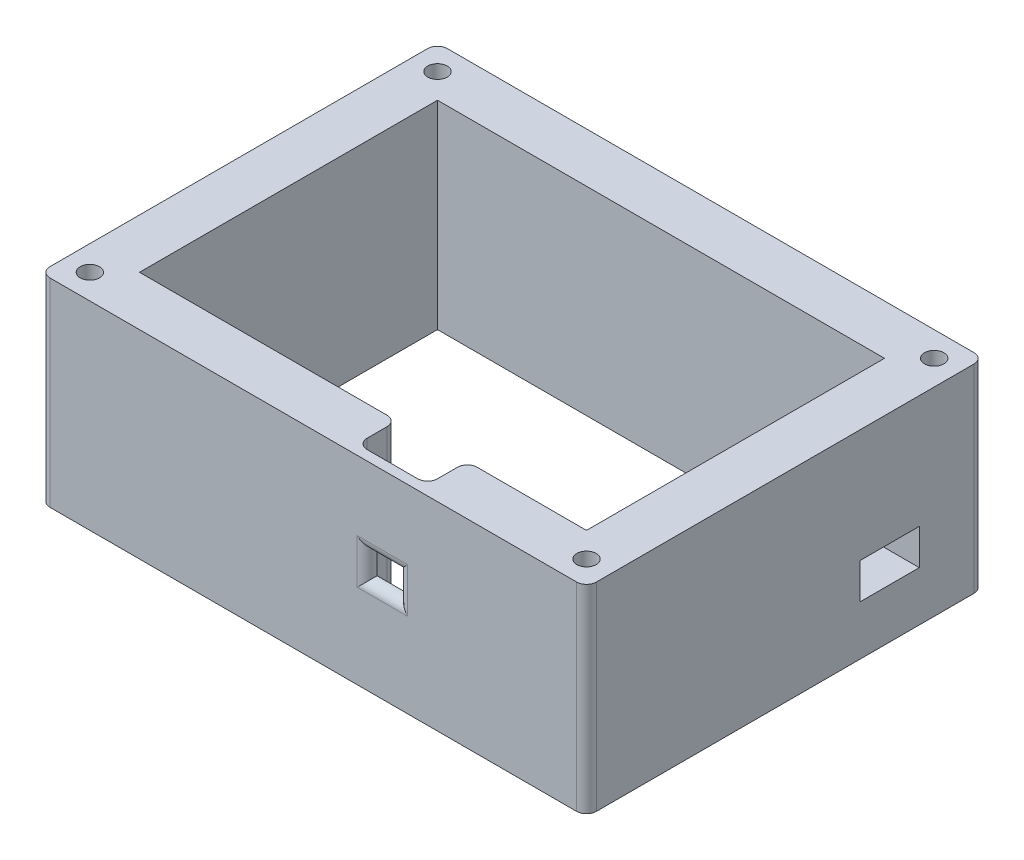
ISO-10303-21;
HEADER;
FILE_DESCRIPTION(('STEP AP214'),'2;1');
FILE_NAME('part.step','',(''),(''),'','','');
FILE_SCHEMA(('AUTOMOTIVE_DESIGN { 1 0 10303 214 1 1 1 1 }'));
ENDSEC;
DATA;
#1=APPLICATION_CONTEXT('core data for automotive mechanical design processes');
#2=APPLICATION_PROTOCOL_DEFINITION('international standard','automotive_design',2000,#1);
#3=PRODUCT_CONTEXT('',#1,'mechanical');
#4=PRODUCT('Part','Part','',(#3));
#5=PRODUCT_RELATED_PRODUCT_CATEGORY('part','',(#4));
#6=PRODUCT_DEFINITION_FORMATION('','',#4);
#7=PRODUCT_DEFINITION_CONTEXT('part definition',#1,'design');
#8=PRODUCT_DEFINITION('design','',#6,#7);
#9=PRODUCT_DEFINITION_SHAPE('','',#8);
#10=(LENGTH_UNIT() NAMED_UNIT(*) SI_UNIT(.MILLI.,.METRE.));
#11=(NAMED_UNIT(*) PLANE_ANGLE_UNIT() SI_UNIT($,.RADIAN.));
#12=(NAMED_UNIT(*) SI_UNIT($,.STERADIAN.) SOLID_ANGLE_UNIT());
#13=UNCERTAINTY_MEASURE_WITH_UNIT(LENGTH_MEASURE(1.E-05),#10,'distance_accuracy_value','');
#14=(GEOMETRIC_REPRESENTATION_CONTEXT(3) GLOBAL_UNCERTAINTY_ASSIGNED_CONTEXT((#13)) GLOBAL_UNIT_ASSIGNED_CONTEXT((#10,
#11,#12)) REPRESENTATION_CONTEXT('',''));
#15=CARTESIAN_POINT('',(0.,0.,0.));
#16=DIRECTION('',(0.,0.,1.));
#17=DIRECTION('',(1.,0.,0.));
#18=AXIS2_PLACEMENT_3D('',#15,#16,#17);
#19=CARTESIAN_POINT('',(-57.15,50.8,38.1));
#20=DIRECTION('',(0.,0.,-1.));
#21=DIRECTION('',(-1.,0.,0.));
#22=AXIS2_PLACEMENT_3D('',#19,#20,#21);
#23=PLANE('',#22);
#24=DIRECTION('',(1.,0.,0.));
#25=VECTOR('',#24,1.);
#26=CARTESIAN_POINT('',(-57.15,50.8,38.1));
#27=LINE('',#26,#25);
#28=CARTESIAN_POINT('',(-57.15,50.8,38.1));
#29=VERTEX_POINT('',#28);
#30=CARTESIAN_POINT('',(6.14523945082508,50.8,38.1));
#31=VERTEX_POINT('',#30);
#32=EDGE_CURVE('E411',#29,#31,#27,.T.);
#33=ORIENTED_EDGE('',*,*,#32,.T.);
#34=DIRECTION('',(0.,-1.,0.));
#35=VECTOR('',#34,1.);
#36=CARTESIAN_POINT('',(6.14523945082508,0.,38.1));
#37=LINE('',#36,#35);
#38=CARTESIAN_POINT('',(6.14523945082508,0.,38.1));
#39=VERTEX_POINT('',#38);
#40=EDGE_CURVE('E516',#31,#39,#37,.T.);
#41=ORIENTED_EDGE('',*,*,#40,.T.);
#42=DIRECTION('',(1.,0.,0.));
#43=VECTOR('',#42,1.);
#44=CARTESIAN_POINT('',(-57.15,0.,38.1));
#45=LINE('',#44,#43);
#46=CARTESIAN_POINT('',(-57.15,0.,38.1));
#47=VERTEX_POINT('',#46);
#48=EDGE_CURVE('E403',#47,#39,#45,.T.);
#49=ORIENTED_EDGE('',*,*,#48,.F.);
#50=DIRECTION('',(0.,-1.,0.));
#51=VECTOR('',#50,1.);
#52=CARTESIAN_POINT('',(-57.15,50.8,38.1));
#53=LINE('',#52,#51);
#54=EDGE_CURVE('E434',#29,#47,#53,.T.);
#55=ORIENTED_EDGE('',*,*,#54,.F.);
#56=EDGE_LOOP('',(#33,#41,#49,#55));
#57=FACE_BOUND('',#56,.T.);
#58=ADVANCED_FACE('F41',(#57),#23,.T.);
#59=CARTESIAN_POINT('',(63.5,50.8,-44.45));
#60=DIRECTION('',(0.,-1.,0.));
#61=DIRECTION('',(0.,0.,-1.));
#62=AXIS2_PLACEMENT_3D('',#59,#60,#61);
#63=CYLINDRICAL_SURFACE('',#62,2.4765);
#64=CARTESIAN_POINT('',(63.5,50.8,-44.45));
#65=DIRECTION('',(0.,1.,0.));
#66=DIRECTION('',(0.,0.,1.));
#67=AXIS2_PLACEMENT_3D('',#64,#65,#66);
#68=CIRCLE('',#67,2.4765);
#69=CARTESIAN_POINT('',(63.5,50.8,-41.9735));
#70=VERTEX_POINT('',#69);
#71=EDGE_CURVE('E394',#70,#70,#68,.T.);
#72=ORIENTED_EDGE('',*,*,#71,.T.);
#73=EDGE_LOOP('',(#72));
#74=FACE_BOUND('',#73,.T.);
#75=CARTESIAN_POINT('',(63.5,30.226,-44.45));
#76=DIRECTION('',(0.,-1.,0.));
#77=DIRECTION('',(0.,0.,-1.));
#78=AXIS2_PLACEMENT_3D('',#75,#76,#77);
#79=CIRCLE('',#78,2.4765);
#80=CARTESIAN_POINT('',(63.5,30.226,-46.9265));
#81=VERTEX_POINT('',#80);
#82=EDGE_CURVE('E374',#81,#81,#79,.T.);
#83=ORIENTED_EDGE('',*,*,#82,.T.);
#84=EDGE_LOOP('',(#83));
#85=FACE_BOUND('',#84,.T.);
#86=ADVANCED_FACE('F679',(#74,#85),#63,.F.);
#87=CARTESIAN_POINT('',(-63.5,50.8,-44.45));
#88=DIRECTION('',(0.,-1.,0.));
#89=DIRECTION('',(0.,0.,-1.));
#90=AXIS2_PLACEMENT_3D('',#87,#88,#89);
#91=CYLINDRICAL_SURFACE('',#90,2.4765);
#92=CARTESIAN_POINT('',(-63.5,50.8,-44.45));
#93=DIRECTION('',(0.,1.,0.));
#94=DIRECTION('',(0.,0.,1.));
#95=AXIS2_PLACEMENT_3D('',#92,#93,#94);
#96=CIRCLE('',#95,2.4765);
#97=CARTESIAN_POINT('',(-63.5,50.8,-41.9735));
#98=VERTEX_POINT('',#97);
#99=EDGE_CURVE('E390',#98,#98,#96,.T.);
#100=ORIENTED_EDGE('',*,*,#99,.T.);
#101=EDGE_LOOP('',(#100));
#102=FACE_BOUND('',#101,.T.);
#103=CARTESIAN_POINT('',(-63.5,30.226,-44.45));
#104=DIRECTION('',(0.,-1.,0.));
#105=DIRECTION('',(0.,0.,-1.));
#106=AXIS2_PLACEMENT_3D('',#103,#104,#105);
#107=CIRCLE('',#106,2.4765);
#108=CARTESIAN_POINT('',(-63.5,30.226,-46.9265));
#109=VERTEX_POINT('',#108);
#110=EDGE_CURVE('E484',#109,#109,#107,.T.);
#111=ORIENTED_EDGE('',*,*,#110,.T.);
#112=EDGE_LOOP('',(#111));
#113=FACE_BOUND('',#112,.T.);
#114=ADVANCED_FACE('F686',(#102,#113),#91,.F.);
#115=CARTESIAN_POINT('',(-63.5,50.8,44.45));
#116=DIRECTION('',(0.,-1.,0.));
#117=DIRECTION('',(0.,0.,-1.));
#118=AXIS2_PLACEMENT_3D('',#115,#116,#117);
#119=CYLINDRICAL_SURFACE('',#118,2.4765);
#120=CARTESIAN_POINT('',(-63.5,50.8,44.45));
#121=DIRECTION('',(0.,1.,0.));
#122=DIRECTION('',(0.,0.,1.));
#123=AXIS2_PLACEMENT_3D('',#120,#121,#122);
#124=CIRCLE('',#123,2.4765);
#125=CARTESIAN_POINT('',(-63.5,50.8,46.9265));
#126=VERTEX_POINT('',#125);
#127=EDGE_CURVE('E386',#126,#126,#124,.T.);
#128=ORIENTED_EDGE('',*,*,#127,.T.);
#129=EDGE_LOOP('',(#128));
#130=FACE_BOUND('',#129,.T.);
#131=CARTESIAN_POINT('',(-63.5,30.226,44.45));
#132=DIRECTION('',(0.,-1.,0.));
#133=DIRECTION('',(0.,0.,-1.));
#134=AXIS2_PLACEMENT_3D('',#131,#132,#133);
#135=CIRCLE('',#134,2.4765);
#136=CARTESIAN_POINT('',(-63.5,30.226,41.9735));
#137=VERTEX_POINT('',#136);
#138=EDGE_CURVE('E480',#137,#137,#135,.T.);
#139=ORIENTED_EDGE('',*,*,#138,.T.);
#140=EDGE_LOOP('',(#139));
#141=FACE_BOUND('',#140,.T.);
#142=ADVANCED_FACE('F900',(#130,#141),#119,.F.);
#143=CARTESIAN_POINT('',(63.5,50.8,44.45));
#144=DIRECTION('',(0.,-1.,0.));
#145=DIRECTION('',(0.,0.,-1.));
#146=AXIS2_PLACEMENT_3D('',#143,#144,#145);
#147=CYLINDRICAL_SURFACE('',#146,2.4765);
#148=CARTESIAN_POINT('',(63.5,50.8,44.45));
#149=DIRECTION('',(0.,1.,0.));
#150=DIRECTION('',(0.,0.,1.));
#151=AXIS2_PLACEMENT_3D('',#148,#149,#150);
#152=CIRCLE('',#151,2.4765);
#153=CARTESIAN_POINT('',(63.5,50.8,46.9265));
#154=VERTEX_POINT('',#153);
#155=EDGE_CURVE('E379',#154,#154,#152,.T.);
#156=ORIENTED_EDGE('',*,*,#155,.T.);
#157=EDGE_LOOP('',(#156));
#158=FACE_BOUND('',#157,.T.);
#159=CARTESIAN_POINT('',(63.5,30.226,44.45));
#160=DIRECTION('',(0.,-1.,0.));
#161=DIRECTION('',(0.,0.,-1.));
#162=AXIS2_PLACEMENT_3D('',#159,#160,#161);
#163=CIRCLE('',#162,2.4765);
#164=CARTESIAN_POINT('',(63.5,30.226,41.9735));
#165=VERTEX_POINT('',#164);
#166=EDGE_CURVE('E345',#165,#165,#163,.T.);
#167=ORIENTED_EDGE('',*,*,#166,.T.);
#168=EDGE_LOOP('',(#167));
#169=FACE_BOUND('',#168,.T.);
#170=ADVANCED_FACE('F897',(#158,#169),#147,.F.);
#171=CARTESIAN_POINT('',(0.,50.8,0.));
#172=DIRECTION('',(0.,-1.,0.));
#173=DIRECTION('',(0.,0.,-1.));
#174=AXIS2_PLACEMENT_3D('',#171,#172,#173);
#175=PLANE('',#174);
#176=DIRECTION('',(-1.,0.,0.));
#177=VECTOR('',#176,1.);
#178=CARTESIAN_POINT('',(-69.85,50.8,-50.8));
#179=LINE('',#178,#177);
#180=CARTESIAN_POINT('',(67.31,50.8,-50.8));
#181=VERTEX_POINT('',#180);
#182=CARTESIAN_POINT('',(-67.31,50.8,-50.8));
#183=VERTEX_POINT('',#182);
#184=EDGE_CURVE('E449',#181,#183,#179,.T.);
#185=ORIENTED_EDGE('',*,*,#184,.T.);
#186=CARTESIAN_POINT('',(-67.31,50.8,-48.26));
#187=DIRECTION('',(0.,-1.,0.));
#188=DIRECTION('',(0.,0.,-1.));
#189=AXIS2_PLACEMENT_3D('',#186,#187,#188);
#190=CIRCLE('',#189,2.54);
#191=CARTESIAN_POINT('',(-69.85,50.8,-48.26));
#192=VERTEX_POINT('',#191);
#193=EDGE_CURVE('E606',#183,#192,#190,.F.);
#194=ORIENTED_EDGE('',*,*,#193,.T.);
#195=DIRECTION('',(0.,0.,1.));
#196=VECTOR('',#195,1.);
#197=CARTESIAN_POINT('',(-69.85,50.8,50.8));
#198=LINE('',#197,#196);
#199=CARTESIAN_POINT('',(-69.85,50.8,48.26));
#200=VERTEX_POINT('',#199);
#201=EDGE_CURVE('E454',#192,#200,#198,.T.);
#202=ORIENTED_EDGE('',*,*,#201,.T.);
#203=CARTESIAN_POINT('',(-67.31,50.8,48.26));
#204=DIRECTION('',(0.,-1.,0.));
#205=DIRECTION('',(0.,0.,-1.));
#206=AXIS2_PLACEMENT_3D('',#203,#204,#205);
#207=CIRCLE('',#206,2.54);
#208=CARTESIAN_POINT('',(-67.31,50.8,50.8));
#209=VERTEX_POINT('',#208);
#210=EDGE_CURVE('E603',#200,#209,#207,.F.);
#211=ORIENTED_EDGE('',*,*,#210,.T.);
#212=DIRECTION('',(1.,0.,0.));
#213=VECTOR('',#212,1.);
#214=CARTESIAN_POINT('',(-69.85,50.8,50.8));
#215=LINE('',#214,#213);
#216=CARTESIAN_POINT('',(67.31,50.8,50.8));
#217=VERTEX_POINT('',#216);
#218=EDGE_CURVE('E458',#209,#217,#215,.T.);
#219=ORIENTED_EDGE('',*,*,#218,.T.);
#220=CARTESIAN_POINT('',(67.31,50.8,48.26));
#221=DIRECTION('',(0.,-1.,0.));
#222=DIRECTION('',(0.,0.,-1.));
#223=AXIS2_PLACEMENT_3D('',#220,#221,#222);
#224=CIRCLE('',#223,2.54);
#225=CARTESIAN_POINT('',(69.85,50.8,48.26));
#226=VERTEX_POINT('',#225);
#227=EDGE_CURVE('E600',#217,#226,#224,.F.);
#228=ORIENTED_EDGE('',*,*,#227,.T.);
#229=DIRECTION('',(0.,0.,-1.));
#230=VECTOR('',#229,1.);
#231=CARTESIAN_POINT('',(69.85,50.8,50.8));
#232=LINE('',#231,#230);
#233=CARTESIAN_POINT('',(69.85,50.8,-48.26));
#234=VERTEX_POINT('',#233);
#235=EDGE_CURVE('E445',#226,#234,#232,.T.);
#236=ORIENTED_EDGE('',*,*,#235,.T.);
#237=CARTESIAN_POINT('',(67.31,50.8,-48.26));
#238=DIRECTION('',(0.,-1.,0.));
#239=DIRECTION('',(0.,0.,-1.));
#240=AXIS2_PLACEMENT_3D('',#237,#238,#239);
#241=CIRCLE('',#240,2.54);
#242=EDGE_CURVE('E597',#234,#181,#241,.F.);
#243=ORIENTED_EDGE('',*,*,#242,.T.);
#244=EDGE_LOOP('',(#185,#194,#202,#211,#219,#228,#236,#243));
#245=FACE_BOUND('',#244,.T.);
#246=CARTESIAN_POINT('',(29.21,50.8,38.1));
#247=VERTEX_POINT('',#246);
#248=CARTESIAN_POINT('',(57.15,50.8,38.1));
#249=VERTEX_POINT('',#248);
#250=EDGE_CURVE('E410',#247,#249,#27,.T.);
#251=ORIENTED_EDGE('',*,*,#250,.F.);
#252=CARTESIAN_POINT('',(29.21,50.8,40.64));
#253=DIRECTION('',(0.,-1.,0.));
#254=DIRECTION('',(0.,0.,-1.));
#255=AXIS2_PLACEMENT_3D('',#252,#253,#254);
#256=CIRCLE('',#255,2.54);
#257=CARTESIAN_POINT('',(26.67,50.8,40.64));
#258=VERTEX_POINT('',#257);
#259=EDGE_CURVE('E513',#247,#258,#256,.F.);
#260=ORIENTED_EDGE('',*,*,#259,.T.);
#261=DIRECTION('',(0.,0.,1.));
#262=VECTOR('',#261,1.);
#263=CARTESIAN_POINT('',(26.67,50.8,38.1));
#264=LINE('',#263,#262);
#265=CARTESIAN_POINT('',(26.67,50.8,45.72));
#266=VERTEX_POINT('',#265);
#267=EDGE_CURVE('E300',#258,#266,#264,.T.);
#268=ORIENTED_EDGE('',*,*,#267,.T.);
#269=CARTESIAN_POINT('',(24.13,50.8,45.72));
#270=DIRECTION('',(0.,-1.,0.));
#271=DIRECTION('',(0.,0.,-1.));
#272=AXIS2_PLACEMENT_3D('',#269,#270,#271);
#273=CIRCLE('',#272,2.54);
#274=CARTESIAN_POINT('',(24.13,50.8,48.26));
#275=VERTEX_POINT('',#274);
#276=EDGE_CURVE('E543',#266,#275,#273,.T.);
#277=ORIENTED_EDGE('',*,*,#276,.T.);
#278=DIRECTION('',(-1.,0.,0.));
#279=VECTOR('',#278,1.);
#280=CARTESIAN_POINT('',(8.68523945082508,50.8,48.26));
#281=LINE('',#280,#279);
#282=CARTESIAN_POINT('',(11.2252394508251,50.8,48.26));
#283=VERTEX_POINT('',#282);
#284=EDGE_CURVE('E304',#275,#283,#281,.T.);
#285=ORIENTED_EDGE('',*,*,#284,.T.);
#286=CARTESIAN_POINT('',(11.2252394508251,50.8,45.72));
#287=DIRECTION('',(0.,-1.,0.));
#288=DIRECTION('',(0.,0.,-1.));
#289=AXIS2_PLACEMENT_3D('',#286,#287,#288);
#290=CIRCLE('',#289,2.54);
#291=CARTESIAN_POINT('',(8.68523945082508,50.8,45.72));
#292=VERTEX_POINT('',#291);
#293=EDGE_CURVE('E537',#283,#292,#290,.T.);
#294=ORIENTED_EDGE('',*,*,#293,.T.);
#295=DIRECTION('',(0.,0.,-1.));
#296=VECTOR('',#295,1.);
#297=CARTESIAN_POINT('',(8.68523945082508,50.8,38.1));
#298=LINE('',#297,#296);
#299=CARTESIAN_POINT('',(8.68523945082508,50.8,40.64));
#300=VERTEX_POINT('',#299);
#301=EDGE_CURVE('E296',#292,#300,#298,.T.);
#302=ORIENTED_EDGE('',*,*,#301,.T.);
#303=CARTESIAN_POINT('',(6.14523945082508,50.8,40.64));
#304=DIRECTION('',(0.,-1.,0.));
#305=DIRECTION('',(0.,0.,-1.));
#306=AXIS2_PLACEMENT_3D('',#303,#304,#305);
#307=CIRCLE('',#306,2.54);
#308=EDGE_CURVE('E510',#300,#31,#307,.F.);
#309=ORIENTED_EDGE('',*,*,#308,.T.);
#310=ORIENTED_EDGE('',*,*,#32,.F.);
#311=DIRECTION('',(0.,0.,1.));
#312=VECTOR('',#311,1.);
#313=CARTESIAN_POINT('',(-57.15,50.8,38.1));
#314=LINE('',#313,#312);
#315=CARTESIAN_POINT('',(-57.15,50.8,-38.1));
#316=VERTEX_POINT('',#315);
#317=EDGE_CURVE('E406',#316,#29,#314,.T.);
#318=ORIENTED_EDGE('',*,*,#317,.F.);
#319=DIRECTION('',(-1.,0.,0.));
#320=VECTOR('',#319,1.);
#321=CARTESIAN_POINT('',(-57.15,50.8,-38.1));
#322=LINE('',#321,#320);
#323=CARTESIAN_POINT('',(57.15,50.8,-38.1));
#324=VERTEX_POINT('',#323);
#325=EDGE_CURVE('E402',#324,#316,#322,.T.);
#326=ORIENTED_EDGE('',*,*,#325,.F.);
#327=DIRECTION('',(0.,0.,-1.));
#328=VECTOR('',#327,1.);
#329=CARTESIAN_POINT('',(57.15,50.8,38.1));
#330=LINE('',#329,#328);
#331=EDGE_CURVE('E399',#249,#324,#330,.T.);
#332=ORIENTED_EDGE('',*,*,#331,.F.);
#333=EDGE_LOOP('',(#251,#260,#268,#277,#285,#294,#302,#309,#310,#318,#326,#332));
#334=FACE_BOUND('',#333,.T.);
#335=ORIENTED_EDGE('',*,*,#71,.F.);
#336=EDGE_LOOP('',(#335));
#337=FACE_BOUND('',#336,.T.);
#338=ORIENTED_EDGE('',*,*,#99,.F.);
#339=EDGE_LOOP('',(#338));
#340=FACE_BOUND('',#339,.T.);
#341=ORIENTED_EDGE('',*,*,#127,.F.);
#342=EDGE_LOOP('',(#341));
#343=FACE_BOUND('',#342,.T.);
#344=ORIENTED_EDGE('',*,*,#155,.F.);
#345=EDGE_LOOP('',(#344));
#346=FACE_BOUND('',#345,.T.);
#347=ADVANCED_FACE('F716',(#245,#334,#337,#340,#343,#346),#175,.F.);
#348=CARTESIAN_POINT('',(0.,0.,0.));
#349=DIRECTION('',(0.,-1.,0.));
#350=DIRECTION('',(0.,0.,-1.));
#351=AXIS2_PLACEMENT_3D('',#348,#349,#350);
#352=PLANE('',#351);
#353=DIRECTION('',(0.,0.,1.));
#354=VECTOR('',#353,1.);
#355=CARTESIAN_POINT('',(26.67,0.,0.));
#356=LINE('',#355,#354);
#357=CARTESIAN_POINT('',(26.67,0.,40.64));
#358=VERTEX_POINT('',#357);
#359=CARTESIAN_POINT('',(26.67,0.,45.72));
#360=VERTEX_POINT('',#359);
#361=EDGE_CURVE('E308',#358,#360,#356,.T.);
#362=ORIENTED_EDGE('',*,*,#361,.F.);
#363=CARTESIAN_POINT('',(29.21,0.,40.64));
#364=DIRECTION('',(0.,-1.,0.));
#365=DIRECTION('',(0.,0.,-1.));
#366=AXIS2_PLACEMENT_3D('',#363,#364,#365);
#367=CIRCLE('',#366,2.54);
#368=CARTESIAN_POINT('',(29.21,0.,38.1));
#369=VERTEX_POINT('',#368);
#370=EDGE_CURVE('E504',#358,#369,#367,.T.);
#371=ORIENTED_EDGE('',*,*,#370,.T.);
#372=CARTESIAN_POINT('',(57.15,0.,38.1));
#373=VERTEX_POINT('',#372);
#374=EDGE_CURVE('E427',#369,#373,#45,.T.);
#375=ORIENTED_EDGE('',*,*,#374,.T.);
#376=DIRECTION('',(0.,0.,-1.));
#377=VECTOR('',#376,1.);
#378=CARTESIAN_POINT('',(57.15,0.,38.1));
#379=LINE('',#378,#377);
#380=CARTESIAN_POINT('',(57.15,0.,-38.1));
#381=VERTEX_POINT('',#380);
#382=EDGE_CURVE('E398',#373,#381,#379,.T.);
#383=ORIENTED_EDGE('',*,*,#382,.T.);
#384=DIRECTION('',(-1.,0.,0.));
#385=VECTOR('',#384,1.);
#386=CARTESIAN_POINT('',(-57.15,0.,-38.1));
#387=LINE('',#386,#385);
#388=CARTESIAN_POINT('',(-57.15,0.,-38.1));
#389=VERTEX_POINT('',#388);
#390=EDGE_CURVE('E419',#381,#389,#387,.T.);
#391=ORIENTED_EDGE('',*,*,#390,.T.);
#392=DIRECTION('',(0.,0.,1.));
#393=VECTOR('',#392,1.);
#394=CARTESIAN_POINT('',(-57.15,0.,38.1));
#395=LINE('',#394,#393);
#396=EDGE_CURVE('E423',#389,#47,#395,.T.);
#397=ORIENTED_EDGE('',*,*,#396,.T.);
#398=ORIENTED_EDGE('',*,*,#48,.T.);
#399=CARTESIAN_POINT('',(6.14523945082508,0.,40.64));
#400=DIRECTION('',(0.,-1.,0.));
#401=DIRECTION('',(0.,0.,-1.));
#402=AXIS2_PLACEMENT_3D('',#399,#400,#401);
#403=CIRCLE('',#402,2.54);
#404=CARTESIAN_POINT('',(8.68523945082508,0.,40.64));
#405=VERTEX_POINT('',#404);
#406=EDGE_CURVE('E501',#39,#405,#403,.T.);
#407=ORIENTED_EDGE('',*,*,#406,.T.);
#408=DIRECTION('',(0.,0.,-1.));
#409=VECTOR('',#408,1.);
#410=CARTESIAN_POINT('',(8.68523945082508,0.,0.));
#411=LINE('',#410,#409);
#412=CARTESIAN_POINT('',(8.68523945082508,0.,45.72));
#413=VERTEX_POINT('',#412);
#414=EDGE_CURVE('E312',#413,#405,#411,.T.);
#415=ORIENTED_EDGE('',*,*,#414,.F.);
#416=CARTESIAN_POINT('',(11.2252394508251,0.,45.72));
#417=DIRECTION('',(0.,-1.,0.));
#418=DIRECTION('',(0.,0.,-1.));
#419=AXIS2_PLACEMENT_3D('',#416,#417,#418);
#420=CIRCLE('',#419,2.54);
#421=CARTESIAN_POINT('',(11.2252394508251,0.,48.26));
#422=VERTEX_POINT('',#421);
#423=EDGE_CURVE('E534',#413,#422,#420,.F.);
#424=ORIENTED_EDGE('',*,*,#423,.T.);
#425=DIRECTION('',(-1.,0.,0.));
#426=VECTOR('',#425,1.);
#427=CARTESIAN_POINT('',(0.,0.,48.26));
#428=LINE('',#427,#426);
#429=CARTESIAN_POINT('',(24.13,0.,48.26));
#430=VERTEX_POINT('',#429);
#431=EDGE_CURVE('E462',#430,#422,#428,.T.);
#432=ORIENTED_EDGE('',*,*,#431,.F.);
#433=CARTESIAN_POINT('',(24.13,0.,45.72));
#434=DIRECTION('',(0.,-1.,0.));
#435=DIRECTION('',(0.,0.,-1.));
#436=AXIS2_PLACEMENT_3D('',#433,#434,#435);
#437=CIRCLE('',#436,2.54);
#438=EDGE_CURVE('E540',#430,#360,#437,.F.);
#439=ORIENTED_EDGE('',*,*,#438,.T.);
#440=EDGE_LOOP('',(#362,#371,#375,#383,#391,#397,#398,#407,#415,#424,#432,#439));
#441=FACE_BOUND('',#440,.T.);
#442=CARTESIAN_POINT('',(-63.5,0.,44.45));
#443=DIRECTION('',(0.,1.,0.));
#444=DIRECTION('',(0.,0.,1.));
#445=AXIS2_PLACEMENT_3D('',#442,#443,#444);
#446=CIRCLE('',#445,5.6515);
#447=CARTESIAN_POINT('',(-63.5,0.,50.1015));
#448=VERTEX_POINT('',#447);
#449=EDGE_CURVE('E370',#448,#448,#446,.T.);
#450=ORIENTED_EDGE('',*,*,#449,.T.);
#451=EDGE_LOOP('',(#450));
#452=FACE_BOUND('',#451,.T.);
#453=CARTESIAN_POINT('',(63.5,0.,44.45));
#454=DIRECTION('',(0.,1.,0.));
#455=DIRECTION('',(0.,0.,1.));
#456=AXIS2_PLACEMENT_3D('',#453,#454,#455);
#457=CIRCLE('',#456,5.6515);
#458=CARTESIAN_POINT('',(63.5,0.,50.1015));
#459=VERTEX_POINT('',#458);
#460=EDGE_CURVE('E362',#459,#459,#457,.T.);
#461=ORIENTED_EDGE('',*,*,#460,.T.);
#462=EDGE_LOOP('',(#461));
#463=FACE_BOUND('',#462,.T.);
#464=CARTESIAN_POINT('',(63.5,0.,-44.45));
#465=DIRECTION('',(0.,1.,0.));
#466=DIRECTION('',(0.,0.,1.));
#467=AXIS2_PLACEMENT_3D('',#464,#465,#466);
#468=CIRCLE('',#467,5.6515);
#469=CARTESIAN_POINT('',(63.5,0.,-38.7985));
#470=VERTEX_POINT('',#469);
#471=EDGE_CURVE('E354',#470,#470,#468,.T.);
#472=ORIENTED_EDGE('',*,*,#471,.T.);
#473=EDGE_LOOP('',(#472));
#474=FACE_BOUND('',#473,.T.);
#475=CARTESIAN_POINT('',(-63.5,0.,-44.45));
#476=DIRECTION('',(0.,1.,0.));
#477=DIRECTION('',(0.,0.,1.));
#478=AXIS2_PLACEMENT_3D('',#475,#476,#477);
#479=CIRCLE('',#478,5.6515);
#480=CARTESIAN_POINT('',(-63.5,0.,-38.7985));
#481=VERTEX_POINT('',#480);
#482=EDGE_CURVE('E353',#481,#481,#479,.T.);
#483=ORIENTED_EDGE('',*,*,#482,.T.);
#484=EDGE_LOOP('',(#483));
#485=FACE_BOUND('',#484,.T.);
#486=DIRECTION('',(0.,0.,1.));
#487=VECTOR('',#486,1.);
#488=CARTESIAN_POINT('',(-69.85,0.,50.8));
#489=LINE('',#488,#487);
#490=CARTESIAN_POINT('',(-69.85,0.,-48.26));
#491=VERTEX_POINT('',#490);
#492=CARTESIAN_POINT('',(-69.85,0.,48.26));
#493=VERTEX_POINT('',#492);
#494=EDGE_CURVE('E470',#491,#493,#489,.T.);
#495=ORIENTED_EDGE('',*,*,#494,.F.);
#496=CARTESIAN_POINT('',(-67.31,0.,-48.26));
#497=DIRECTION('',(0.,-1.,0.));
#498=DIRECTION('',(0.,0.,-1.));
#499=AXIS2_PLACEMENT_3D('',#496,#497,#498);
#500=CIRCLE('',#499,2.54);
#501=CARTESIAN_POINT('',(-67.31,0.,-50.8));
#502=VERTEX_POINT('',#501);
#503=EDGE_CURVE('E587',#491,#502,#500,.T.);
#504=ORIENTED_EDGE('',*,*,#503,.T.);
#505=DIRECTION('',(-1.,0.,0.));
#506=VECTOR('',#505,1.);
#507=CARTESIAN_POINT('',(-69.85,0.,-50.8));
#508=LINE('',#507,#506);
#509=CARTESIAN_POINT('',(67.31,0.,-50.8));
#510=VERTEX_POINT('',#509);
#511=EDGE_CURVE('E466',#510,#502,#508,.T.);
#512=ORIENTED_EDGE('',*,*,#511,.F.);
#513=CARTESIAN_POINT('',(67.31,0.,-48.26));
#514=DIRECTION('',(0.,-1.,0.));
#515=DIRECTION('',(0.,0.,-1.));
#516=AXIS2_PLACEMENT_3D('',#513,#514,#515);
#517=CIRCLE('',#516,2.54);
#518=CARTESIAN_POINT('',(69.85,0.,-48.26));
#519=VERTEX_POINT('',#518);
#520=EDGE_CURVE('E578',#510,#519,#517,.T.);
#521=ORIENTED_EDGE('',*,*,#520,.T.);
#522=DIRECTION('',(0.,0.,-1.));
#523=VECTOR('',#522,1.);
#524=CARTESIAN_POINT('',(69.85,0.,50.8));
#525=LINE('',#524,#523);
#526=CARTESIAN_POINT('',(69.85,0.,48.26));
#527=VERTEX_POINT('',#526);
#528=EDGE_CURVE('E444',#527,#519,#525,.T.);
#529=ORIENTED_EDGE('',*,*,#528,.F.);
#530=CARTESIAN_POINT('',(67.31,0.,48.26));
#531=DIRECTION('',(0.,-1.,0.));
#532=DIRECTION('',(0.,0.,-1.));
#533=AXIS2_PLACEMENT_3D('',#530,#531,#532);
#534=CIRCLE('',#533,2.54);
#535=CARTESIAN_POINT('',(67.31,0.,50.8));
#536=VERTEX_POINT('',#535);
#537=EDGE_CURVE('E581',#527,#536,#534,.T.);
#538=ORIENTED_EDGE('',*,*,#537,.T.);
#539=DIRECTION('',(1.,0.,0.));
#540=VECTOR('',#539,1.);
#541=CARTESIAN_POINT('',(-69.85,0.,50.8));
#542=LINE('',#541,#540);
#543=CARTESIAN_POINT('',(-67.31,0.,50.8));
#544=VERTEX_POINT('',#543);
#545=EDGE_CURVE('E450',#544,#536,#542,.T.);
#546=ORIENTED_EDGE('',*,*,#545,.F.);
#547=CARTESIAN_POINT('',(-67.31,0.,48.26));
#548=DIRECTION('',(0.,-1.,0.));
#549=DIRECTION('',(0.,0.,-1.));
#550=AXIS2_PLACEMENT_3D('',#547,#548,#549);
#551=CIRCLE('',#550,2.54);
#552=EDGE_CURVE('E584',#544,#493,#551,.T.);
#553=ORIENTED_EDGE('',*,*,#552,.T.);
#554=EDGE_LOOP('',(#495,#504,#512,#521,#529,#538,#546,#553));
#555=FACE_BOUND('',#554,.T.);
#556=ADVANCED_FACE('F755',(#441,#452,#463,#474,#485,#555),#352,.T.);
#557=CARTESIAN_POINT('',(69.85,50.8,50.8));
#558=DIRECTION('',(-1.,0.,0.));
#559=DIRECTION('',(0.,0.,1.));
#560=AXIS2_PLACEMENT_3D('',#557,#558,#559);
#561=PLANE('',#560);
#562=DIRECTION('',(0.,0.,1.));
#563=VECTOR('',#562,1.);
#564=CARTESIAN_POINT('',(69.85,21.844,-19.1262));
#565=LINE('',#564,#563);
#566=CARTESIAN_POINT('',(69.85,21.844,-34.29));
#567=VERTEX_POINT('',#566);
#568=CARTESIAN_POINT('',(69.85,21.844,-19.1262));
#569=VERTEX_POINT('',#568);
#570=EDGE_CURVE('E253',#567,#569,#565,.T.);
#571=ORIENTED_EDGE('',*,*,#570,.F.);
#572=DIRECTION('',(0.,1.,0.));
#573=VECTOR('',#572,1.);
#574=CARTESIAN_POINT('',(69.85,12.7,-34.29));
#575=LINE('',#574,#573);
#576=CARTESIAN_POINT('',(69.85,12.7,-34.29));
#577=VERTEX_POINT('',#576);
#578=EDGE_CURVE('E259',#577,#567,#575,.T.);
#579=ORIENTED_EDGE('',*,*,#578,.F.);
#580=DIRECTION('',(0.,0.,-1.));
#581=VECTOR('',#580,1.);
#582=CARTESIAN_POINT('',(69.85,12.7,-19.1262));
#583=LINE('',#582,#581);
#584=CARTESIAN_POINT('',(69.85,12.7,-19.1262));
#585=VERTEX_POINT('',#584);
#586=EDGE_CURVE('E264',#585,#577,#583,.T.);
#587=ORIENTED_EDGE('',*,*,#586,.F.);
#588=DIRECTION('',(0.,-1.,0.));
#589=VECTOR('',#588,1.);
#590=CARTESIAN_POINT('',(69.85,12.7,-19.1262));
#591=LINE('',#590,#589);
#592=EDGE_CURVE('E244',#569,#585,#591,.T.);
#593=ORIENTED_EDGE('',*,*,#592,.F.);
#594=EDGE_LOOP('',(#571,#579,#587,#593));
#595=FACE_BOUND('',#594,.T.);
#596=ORIENTED_EDGE('',*,*,#235,.F.);
#597=DIRECTION('',(0.,-1.,0.));
#598=VECTOR('',#597,1.);
#599=CARTESIAN_POINT('',(69.85,50.8,48.26));
#600=LINE('',#599,#598);
#601=EDGE_CURVE('E619',#226,#527,#600,.T.);
#602=ORIENTED_EDGE('',*,*,#601,.T.);
#603=ORIENTED_EDGE('',*,*,#528,.T.);
#604=DIRECTION('',(0.,-1.,0.));
#605=VECTOR('',#604,1.);
#606=CARTESIAN_POINT('',(69.85,50.8,-48.26));
#607=LINE('',#606,#605);
#608=EDGE_CURVE('E616',#519,#234,#607,.F.);
#609=ORIENTED_EDGE('',*,*,#608,.T.);
#610=EDGE_LOOP('',(#596,#602,#603,#609));
#611=FACE_BOUND('',#610,.T.);
#612=ADVANCED_FACE('F261',(#595,#611),#561,.F.);
#613=CARTESIAN_POINT('',(-69.85,50.8,-50.8));
#614=DIRECTION('',(0.,0.,1.));
#615=DIRECTION('',(1.,0.,0.));
#616=AXIS2_PLACEMENT_3D('',#613,#614,#615);
#617=PLANE('',#616);
#618=ORIENTED_EDGE('',*,*,#511,.T.);
#619=DIRECTION('',(0.,-1.,0.));
#620=VECTOR('',#619,1.);
#621=CARTESIAN_POINT('',(-67.31,50.8,-50.8));
#622=LINE('',#621,#620);
#623=EDGE_CURVE('E594',#502,#183,#622,.F.);
#624=ORIENTED_EDGE('',*,*,#623,.T.);
#625=ORIENTED_EDGE('',*,*,#184,.F.);
#626=DIRECTION('',(0.,-1.,0.));
#627=VECTOR('',#626,1.);
#628=CARTESIAN_POINT('',(67.31,50.8,-50.8));
#629=LINE('',#628,#627);
#630=EDGE_CURVE('E590',#181,#510,#629,.T.);
#631=ORIENTED_EDGE('',*,*,#630,.T.);
#632=EDGE_LOOP('',(#618,#624,#625,#631));
#633=FACE_BOUND('',#632,.T.);
#634=ADVANCED_FACE('F798',(#633),#617,.F.);
#635=CARTESIAN_POINT('',(-69.85,50.8,50.8));
#636=DIRECTION('',(1.,0.,0.));
#637=DIRECTION('',(0.,0.,-1.));
#638=AXIS2_PLACEMENT_3D('',#635,#636,#637);
#639=PLANE('',#638);
#640=ORIENTED_EDGE('',*,*,#201,.F.);
#641=DIRECTION('',(0.,-1.,0.));
#642=VECTOR('',#641,1.);
#643=CARTESIAN_POINT('',(-69.85,50.8,-48.26));
#644=LINE('',#643,#642);
#645=EDGE_CURVE('E574',#192,#491,#644,.T.);
#646=ORIENTED_EDGE('',*,*,#645,.T.);
#647=ORIENTED_EDGE('',*,*,#494,.T.);
#648=DIRECTION('',(0.,-1.,0.));
#649=VECTOR('',#648,1.);
#650=CARTESIAN_POINT('',(-69.85,50.8,48.26));
#651=LINE('',#650,#649);
#652=EDGE_CURVE('E559',#493,#200,#651,.F.);
#653=ORIENTED_EDGE('',*,*,#652,.T.);
#654=EDGE_LOOP('',(#640,#646,#647,#653));
#655=FACE_BOUND('',#654,.T.);
#656=ADVANCED_FACE('F773',(#655),#639,.F.);
#657=CARTESIAN_POINT('',(-69.85,50.8,50.8));
#658=DIRECTION('',(0.,0.,-1.));
#659=DIRECTION('',(-1.,0.,0.));
#660=AXIS2_PLACEMENT_3D('',#657,#658,#659);
#661=PLANE('',#660);
#662=DIRECTION('',(0.,-1.,0.));
#663=VECTOR('',#662,1.);
#664=CARTESIAN_POINT('',(24.13,50.8,50.8));
#665=LINE('',#664,#663);
#666=CARTESIAN_POINT('',(24.13,33.02,50.8));
#667=VERTEX_POINT('',#666);
#668=CARTESIAN_POINT('',(24.13,21.59,50.8));
#669=VERTEX_POINT('',#668);
#670=EDGE_CURVE('E552',#667,#669,#665,.T.);
#671=ORIENTED_EDGE('',*,*,#670,.T.);
#672=DIRECTION('',(-1.,0.,0.));
#673=VECTOR('',#672,1.);
#674=CARTESIAN_POINT('',(-69.85,21.59,50.8));
#675=LINE('',#674,#673);
#676=CARTESIAN_POINT('',(11.2252394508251,21.59,50.8));
#677=VERTEX_POINT('',#676);
#678=EDGE_CURVE('E555',#669,#677,#675,.T.);
#679=ORIENTED_EDGE('',*,*,#678,.T.);
#680=DIRECTION('',(0.,1.,0.));
#681=VECTOR('',#680,1.);
#682=CARTESIAN_POINT('',(11.2252394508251,50.8,50.8));
#683=LINE('',#682,#681);
#684=CARTESIAN_POINT('',(11.2252394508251,33.02,50.8));
#685=VERTEX_POINT('',#684);
#686=EDGE_CURVE('E549',#677,#685,#683,.T.);
#687=ORIENTED_EDGE('',*,*,#686,.T.);
#688=DIRECTION('',(1.,0.,0.));
#689=VECTOR('',#688,1.);
#690=CARTESIAN_POINT('',(-69.85,33.02,50.8));
#691=LINE('',#690,#689);
#692=EDGE_CURVE('E546',#685,#667,#691,.T.);
#693=ORIENTED_EDGE('',*,*,#692,.T.);
#694=EDGE_LOOP('',(#671,#679,#687,#693));
#695=FACE_BOUND('',#694,.T.);
#696=ORIENTED_EDGE('',*,*,#218,.F.);
#697=DIRECTION('',(0.,-1.,0.));
#698=VECTOR('',#697,1.);
#699=CARTESIAN_POINT('',(-67.31,50.8,50.8));
#700=LINE('',#699,#698);
#701=EDGE_CURVE('E612',#209,#544,#700,.T.);
#702=ORIENTED_EDGE('',*,*,#701,.T.);
#703=ORIENTED_EDGE('',*,*,#545,.T.);
#704=DIRECTION('',(0.,-1.,0.));
#705=VECTOR('',#704,1.);
#706=CARTESIAN_POINT('',(67.31,50.8,50.8));
#707=LINE('',#706,#705);
#708=EDGE_CURVE('E609',#536,#217,#707,.F.);
#709=ORIENTED_EDGE('',*,*,#708,.T.);
#710=EDGE_LOOP('',(#696,#702,#703,#709));
#711=FACE_BOUND('',#710,.T.);
#712=ADVANCED_FACE('F783',(#695,#711),#661,.F.);
#713=CARTESIAN_POINT('',(57.15,50.8,38.1));
#714=DIRECTION('',(-1.,0.,0.));
#715=DIRECTION('',(0.,0.,1.));
#716=AXIS2_PLACEMENT_3D('',#713,#714,#715);
#717=PLANE('',#716);
#718=DIRECTION('',(0.,0.,-1.));
#719=VECTOR('',#718,1.);
#720=CARTESIAN_POINT('',(57.15,24.384,-19.1262));
#721=LINE('',#720,#719);
#722=CARTESIAN_POINT('',(57.15,24.384,-36.83));
#723=VERTEX_POINT('',#722);
#724=CARTESIAN_POINT('',(57.15,24.384,-16.5862));
#725=VERTEX_POINT('',#724);
#726=EDGE_CURVE('E625',#723,#725,#721,.F.);
#727=ORIENTED_EDGE('',*,*,#726,.T.);
#728=DIRECTION('',(0.,1.,0.));
#729=VECTOR('',#728,1.);
#730=CARTESIAN_POINT('',(57.15,12.7,-16.5862));
#731=LINE('',#730,#729);
#732=CARTESIAN_POINT('',(57.15,10.16,-16.5862));
#733=VERTEX_POINT('',#732);
#734=EDGE_CURVE('E634',#725,#733,#731,.F.);
#735=ORIENTED_EDGE('',*,*,#734,.T.);
#736=DIRECTION('',(0.,0.,1.));
#737=VECTOR('',#736,1.);
#738=CARTESIAN_POINT('',(57.15,10.16,-34.29));
#739=LINE('',#738,#737);
#740=CARTESIAN_POINT('',(57.15,10.16,-36.83));
#741=VERTEX_POINT('',#740);
#742=EDGE_CURVE('E631',#733,#741,#739,.F.);
#743=ORIENTED_EDGE('',*,*,#742,.T.);
#744=DIRECTION('',(0.,-1.,0.));
#745=VECTOR('',#744,1.);
#746=CARTESIAN_POINT('',(57.15,21.844,-36.83));
#747=LINE('',#746,#745);
#748=EDGE_CURVE('E628',#741,#723,#747,.F.);
#749=ORIENTED_EDGE('',*,*,#748,.T.);
#750=EDGE_LOOP('',(#727,#735,#743,#749));
#751=FACE_BOUND('',#750,.T.);
#752=ORIENTED_EDGE('',*,*,#382,.F.);
#753=DIRECTION('',(0.,-1.,0.));
#754=VECTOR('',#753,1.);
#755=CARTESIAN_POINT('',(57.15,50.8,38.1));
#756=LINE('',#755,#754);
#757=EDGE_CURVE('E415',#249,#373,#756,.T.);
#758=ORIENTED_EDGE('',*,*,#757,.F.);
#759=ORIENTED_EDGE('',*,*,#331,.T.);
#760=DIRECTION('',(0.,-1.,0.));
#761=VECTOR('',#760,1.);
#762=CARTESIAN_POINT('',(57.15,50.8,-38.1));
#763=LINE('',#762,#761);
#764=EDGE_CURVE('E440',#324,#381,#763,.T.);
#765=ORIENTED_EDGE('',*,*,#764,.T.);
#766=EDGE_LOOP('',(#752,#758,#759,#765));
#767=FACE_BOUND('',#766,.T.);
#768=ADVANCED_FACE('F754',(#751,#767),#717,.T.);
#769=CARTESIAN_POINT('',(-57.15,50.8,-38.1));
#770=DIRECTION('',(0.,0.,1.));
#771=DIRECTION('',(1.,0.,0.));
#772=AXIS2_PLACEMENT_3D('',#769,#770,#771);
#773=PLANE('',#772);
#774=ORIENTED_EDGE('',*,*,#390,.F.);
#775=ORIENTED_EDGE('',*,*,#764,.F.);
#776=ORIENTED_EDGE('',*,*,#325,.T.);
#777=DIRECTION('',(0.,-1.,0.));
#778=VECTOR('',#777,1.);
#779=CARTESIAN_POINT('',(-57.15,50.8,-38.1));
#780=LINE('',#779,#778);
#781=EDGE_CURVE('E437',#316,#389,#780,.T.);
#782=ORIENTED_EDGE('',*,*,#781,.T.);
#783=EDGE_LOOP('',(#774,#775,#776,#782));
#784=FACE_BOUND('',#783,.T.);
#785=ADVANCED_FACE('F701',(#784),#773,.T.);
#786=CARTESIAN_POINT('',(-57.15,50.8,38.1));
#787=DIRECTION('',(1.,0.,0.));
#788=DIRECTION('',(0.,0.,-1.));
#789=AXIS2_PLACEMENT_3D('',#786,#787,#788);
#790=PLANE('',#789);
#791=ORIENTED_EDGE('',*,*,#396,.F.);
#792=ORIENTED_EDGE('',*,*,#781,.F.);
#793=ORIENTED_EDGE('',*,*,#317,.T.);
#794=ORIENTED_EDGE('',*,*,#54,.T.);
#795=EDGE_LOOP('',(#791,#792,#793,#794));
#796=FACE_BOUND('',#795,.T.);
#797=ADVANCED_FACE('F692',(#796),#790,.T.);
#798=ORIENTED_EDGE('',*,*,#374,.F.);
#799=DIRECTION('',(0.,-1.,0.));
#800=VECTOR('',#799,1.);
#801=CARTESIAN_POINT('',(29.21,50.8,38.1));
#802=LINE('',#801,#800);
#803=EDGE_CURVE('E507',#369,#247,#802,.F.);
#804=ORIENTED_EDGE('',*,*,#803,.T.);
#805=ORIENTED_EDGE('',*,*,#250,.T.);
#806=ORIENTED_EDGE('',*,*,#757,.T.);
#807=EDGE_LOOP('',(#798,#804,#805,#806));
#808=FACE_BOUND('',#807,.T.);
#809=ADVANCED_FACE('F682',(#808),#23,.T.);
#810=CARTESIAN_POINT('',(63.5,20.32,44.45));
#811=DIRECTION('',(0.,-1.,0.));
#812=DIRECTION('',(0.,0.,-1.));
#813=AXIS2_PLACEMENT_3D('',#810,#811,#812);
#814=CYLINDRICAL_SURFACE('',#813,5.6515);
#815=CARTESIAN_POINT('',(63.5,20.32,44.45));
#816=DIRECTION('',(0.,1.,0.));
#817=DIRECTION('',(0.,0.,1.));
#818=AXIS2_PLACEMENT_3D('',#815,#816,#817);
#819=CIRCLE('',#818,5.6515);
#820=CARTESIAN_POINT('',(63.5,20.32,50.1015));
#821=VERTEX_POINT('',#820);
#822=EDGE_CURVE('E358',#821,#821,#819,.T.);
#823=ORIENTED_EDGE('',*,*,#822,.T.);
#824=EDGE_LOOP('',(#823));
#825=FACE_BOUND('',#824,.T.);
#826=ORIENTED_EDGE('',*,*,#460,.F.);
#827=EDGE_LOOP('',(#826));
#828=FACE_BOUND('',#827,.T.);
#829=ADVANCED_FACE('F691',(#825,#828),#814,.F.);
#830=CARTESIAN_POINT('',(63.5,20.32,44.45));
#831=DIRECTION('',(0.,1.,0.));
#832=DIRECTION('',(0.,0.,1.));
#833=AXIS2_PLACEMENT_3D('',#830,#831,#832);
#834=PLANE('',#833);
#835=CARTESIAN_POINT('',(63.5,20.32,44.45));
#836=DIRECTION('',(0.,-1.,0.));
#837=DIRECTION('',(0.,0.,-1.));
#838=AXIS2_PLACEMENT_3D('',#835,#836,#837);
#839=CIRCLE('',#838,2.9845);
#840=CARTESIAN_POINT('',(63.5,20.32,41.4655));
#841=VERTEX_POINT('',#840);
#842=EDGE_CURVE('E330',#841,#841,#839,.T.);
#843=ORIENTED_EDGE('',*,*,#842,.F.);
#844=EDGE_LOOP('',(#843));
#845=FACE_BOUND('',#844,.T.);
#846=ORIENTED_EDGE('',*,*,#822,.F.);
#847=EDGE_LOOP('',(#846));
#848=FACE_BOUND('',#847,.T.);
#849=ADVANCED_FACE('F698',(#845,#848),#834,.F.);
#850=CARTESIAN_POINT('',(-63.5,20.32,44.45));
#851=DIRECTION('',(0.,-1.,0.));
#852=DIRECTION('',(0.,0.,-1.));
#853=AXIS2_PLACEMENT_3D('',#850,#851,#852);
#854=CYLINDRICAL_SURFACE('',#853,5.6515);
#855=CARTESIAN_POINT('',(-63.5,20.32,44.45));
#856=DIRECTION('',(0.,1.,0.));
#857=DIRECTION('',(0.,0.,1.));
#858=AXIS2_PLACEMENT_3D('',#855,#856,#857);
#859=CIRCLE('',#858,5.6515);
#860=CARTESIAN_POINT('',(-63.5,20.32,50.1015));
#861=VERTEX_POINT('',#860);
#862=EDGE_CURVE('E366',#861,#861,#859,.T.);
#863=ORIENTED_EDGE('',*,*,#862,.T.);
#864=EDGE_LOOP('',(#863));
#865=FACE_BOUND('',#864,.T.);
#866=ORIENTED_EDGE('',*,*,#449,.F.);
#867=EDGE_LOOP('',(#866));
#868=FACE_BOUND('',#867,.T.);
#869=ADVANCED_FACE('F880',(#865,#868),#854,.F.);
#870=CARTESIAN_POINT('',(-63.5,20.32,44.45));
#871=DIRECTION('',(0.,1.,0.));
#872=DIRECTION('',(0.,0.,1.));
#873=AXIS2_PLACEMENT_3D('',#870,#871,#872);
#874=PLANE('',#873);
#875=CARTESIAN_POINT('',(-63.5,20.32,44.45));
#876=DIRECTION('',(0.,-1.,0.));
#877=DIRECTION('',(0.,0.,-1.));
#878=AXIS2_PLACEMENT_3D('',#875,#876,#877);
#879=CIRCLE('',#878,2.9845);
#880=CARTESIAN_POINT('',(-63.5,20.32,41.4655));
#881=VERTEX_POINT('',#880);
#882=EDGE_CURVE('E316',#881,#881,#879,.T.);
#883=ORIENTED_EDGE('',*,*,#882,.F.);
#884=EDGE_LOOP('',(#883));
#885=FACE_BOUND('',#884,.T.);
#886=ORIENTED_EDGE('',*,*,#862,.F.);
#887=EDGE_LOOP('',(#886));
#888=FACE_BOUND('',#887,.T.);
#889=ADVANCED_FACE('F883',(#885,#888),#874,.F.);
#890=CARTESIAN_POINT('',(-63.5,20.32,-44.45));
#891=DIRECTION('',(0.,-1.,0.));
#892=DIRECTION('',(0.,0.,-1.));
#893=AXIS2_PLACEMENT_3D('',#890,#891,#892);
#894=CYLINDRICAL_SURFACE('',#893,5.6515);
#895=CARTESIAN_POINT('',(-63.5,20.32,-44.45));
#896=DIRECTION('',(0.,1.,0.));
#897=DIRECTION('',(0.,0.,1.));
#898=AXIS2_PLACEMENT_3D('',#895,#896,#897);
#899=CIRCLE('',#898,5.6515);
#900=CARTESIAN_POINT('',(-63.5,20.32,-38.7985));
#901=VERTEX_POINT('',#900);
#902=EDGE_CURVE('E375',#901,#901,#899,.T.);
#903=ORIENTED_EDGE('',*,*,#902,.T.);
#904=EDGE_LOOP('',(#903));
#905=FACE_BOUND('',#904,.T.);
#906=ORIENTED_EDGE('',*,*,#482,.F.);
#907=EDGE_LOOP('',(#906));
#908=FACE_BOUND('',#907,.T.);
#909=ADVANCED_FACE('F886',(#905,#908),#894,.F.);
#910=CARTESIAN_POINT('',(-63.5,20.32,-44.45));
#911=DIRECTION('',(0.,1.,0.));
#912=DIRECTION('',(0.,0.,1.));
#913=AXIS2_PLACEMENT_3D('',#910,#911,#912);
#914=PLANE('',#913);
#915=CARTESIAN_POINT('',(-63.5,20.32,-44.45));
#916=DIRECTION('',(0.,-1.,0.));
#917=DIRECTION('',(0.,0.,-1.));
#918=AXIS2_PLACEMENT_3D('',#915,#916,#917);
#919=CIRCLE('',#918,2.9845);
#920=CARTESIAN_POINT('',(-63.5,20.32,-47.4345));
#921=VERTEX_POINT('',#920);
#922=EDGE_CURVE('E321',#921,#921,#919,.T.);
#923=ORIENTED_EDGE('',*,*,#922,.F.);
#924=EDGE_LOOP('',(#923));
#925=FACE_BOUND('',#924,.T.);
#926=ORIENTED_EDGE('',*,*,#902,.F.);
#927=EDGE_LOOP('',(#926));
#928=FACE_BOUND('',#927,.T.);
#929=ADVANCED_FACE('F877',(#925,#928),#914,.F.);
#930=CARTESIAN_POINT('',(63.5,20.32,-44.45));
#931=DIRECTION('',(0.,-1.,0.));
#932=DIRECTION('',(0.,0.,-1.));
#933=AXIS2_PLACEMENT_3D('',#930,#931,#932);
#934=CYLINDRICAL_SURFACE('',#933,5.6515);
#935=CARTESIAN_POINT('',(63.5,20.32,-44.45));
#936=DIRECTION('',(0.,1.,0.));
#937=DIRECTION('',(0.,0.,1.));
#938=AXIS2_PLACEMENT_3D('',#935,#936,#937);
#939=CIRCLE('',#938,5.6515);
#940=CARTESIAN_POINT('',(63.5,20.32,-38.7985));
#941=VERTEX_POINT('',#940);
#942=EDGE_CURVE('E349',#941,#941,#939,.T.);
#943=ORIENTED_EDGE('',*,*,#942,.T.);
#944=EDGE_LOOP('',(#943));
#945=FACE_BOUND('',#944,.T.);
#946=ORIENTED_EDGE('',*,*,#471,.F.);
#947=EDGE_LOOP('',(#946));
#948=FACE_BOUND('',#947,.T.);
#949=ADVANCED_FACE('F873',(#945,#948),#934,.F.);
#950=CARTESIAN_POINT('',(63.5,20.32,-44.45));
#951=DIRECTION('',(0.,1.,0.));
#952=DIRECTION('',(0.,0.,1.));
#953=AXIS2_PLACEMENT_3D('',#950,#951,#952);
#954=PLANE('',#953);
#955=CARTESIAN_POINT('',(63.5,20.32,-44.45));
#956=DIRECTION('',(0.,-1.,0.));
#957=DIRECTION('',(0.,0.,-1.));
#958=AXIS2_PLACEMENT_3D('',#955,#956,#957);
#959=CIRCLE('',#958,2.9845);
#960=CARTESIAN_POINT('',(63.5,20.32,-47.4345));
#961=VERTEX_POINT('',#960);
#962=EDGE_CURVE('E322',#961,#961,#959,.T.);
#963=ORIENTED_EDGE('',*,*,#962,.F.);
#964=EDGE_LOOP('',(#963));
#965=FACE_BOUND('',#964,.T.);
#966=ORIENTED_EDGE('',*,*,#942,.F.);
#967=EDGE_LOOP('',(#966));
#968=FACE_BOUND('',#967,.T.);
#969=ADVANCED_FACE('F847',(#965,#968),#954,.F.);
#970=CARTESIAN_POINT('',(63.5,30.226,-44.45));
#971=DIRECTION('',(0.,-1.,0.));
#972=DIRECTION('',(0.,0.,-1.));
#973=AXIS2_PLACEMENT_3D('',#970,#971,#972);
#974=CYLINDRICAL_SURFACE('',#973,2.9845);
#975=CARTESIAN_POINT('',(63.5,30.226,-44.45));
#976=DIRECTION('',(0.,-1.,0.));
#977=DIRECTION('',(0.,0.,-1.));
#978=AXIS2_PLACEMENT_3D('',#975,#976,#977);
#979=CIRCLE('',#978,2.9845);
#980=CARTESIAN_POINT('',(63.5,30.226,-47.4345));
#981=VERTEX_POINT('',#980);
#982=EDGE_CURVE('E317',#981,#981,#979,.T.);
#983=ORIENTED_EDGE('',*,*,#982,.F.);
#984=EDGE_LOOP('',(#983));
#985=FACE_BOUND('',#984,.T.);
#986=ORIENTED_EDGE('',*,*,#962,.T.);
#987=EDGE_LOOP('',(#986));
#988=FACE_BOUND('',#987,.T.);
#989=ADVANCED_FACE('F843',(#985,#988),#974,.F.);
#990=CARTESIAN_POINT('',(63.5,30.226,-44.45));
#991=DIRECTION('',(0.,-1.,0.));
#992=DIRECTION('',(0.,0.,-1.));
#993=AXIS2_PLACEMENT_3D('',#990,#991,#992);
#994=PLANE('',#993);
#995=ORIENTED_EDGE('',*,*,#82,.F.);
#996=EDGE_LOOP('',(#995));
#997=FACE_BOUND('',#996,.T.);
#998=ORIENTED_EDGE('',*,*,#982,.T.);
#999=EDGE_LOOP('',(#998));
#1000=FACE_BOUND('',#999,.T.);
#1001=ADVANCED_FACE('F839',(#997,#1000),#994,.T.);
#1002=CARTESIAN_POINT('',(-63.5,30.226,-44.45));
#1003=DIRECTION('',(0.,-1.,0.));
#1004=DIRECTION('',(0.,0.,-1.));
#1005=AXIS2_PLACEMENT_3D('',#1002,#1003,#1004);
#1006=CYLINDRICAL_SURFACE('',#1005,2.9845);
#1007=CARTESIAN_POINT('',(-63.5,30.226,-44.45));
#1008=DIRECTION('',(0.,-1.,0.));
#1009=DIRECTION('',(0.,0.,-1.));
#1010=AXIS2_PLACEMENT_3D('',#1007,#1008,#1009);
#1011=CIRCLE('',#1010,2.9845);
#1012=CARTESIAN_POINT('',(-63.5,30.226,-47.4345));
#1013=VERTEX_POINT('',#1012);
#1014=EDGE_CURVE('E341',#1013,#1013,#1011,.T.);
#1015=ORIENTED_EDGE('',*,*,#1014,.F.);
#1016=EDGE_LOOP('',(#1015));
#1017=FACE_BOUND('',#1016,.T.);
#1018=ORIENTED_EDGE('',*,*,#922,.T.);
#1019=EDGE_LOOP('',(#1018));
#1020=FACE_BOUND('',#1019,.T.);
#1021=ADVANCED_FACE('F842',(#1017,#1020),#1006,.F.);
#1022=CARTESIAN_POINT('',(-63.5,30.226,-44.45));
#1023=DIRECTION('',(0.,-1.,0.));
#1024=DIRECTION('',(0.,0.,-1.));
#1025=AXIS2_PLACEMENT_3D('',#1022,#1023,#1024);
#1026=PLANE('',#1025);
#1027=ORIENTED_EDGE('',*,*,#110,.F.);
#1028=EDGE_LOOP('',(#1027));
#1029=FACE_BOUND('',#1028,.T.);
#1030=ORIENTED_EDGE('',*,*,#1014,.T.);
#1031=EDGE_LOOP('',(#1030));
#1032=FACE_BOUND('',#1031,.T.);
#1033=ADVANCED_FACE('F863',(#1029,#1032),#1026,.T.);
#1034=CARTESIAN_POINT('',(-63.5,30.226,44.45));
#1035=DIRECTION('',(0.,-1.,0.));
#1036=DIRECTION('',(0.,0.,-1.));
#1037=AXIS2_PLACEMENT_3D('',#1034,#1035,#1036);
#1038=CYLINDRICAL_SURFACE('',#1037,2.9845);
#1039=CARTESIAN_POINT('',(-63.5,30.226,44.45));
#1040=DIRECTION('',(0.,-1.,0.));
#1041=DIRECTION('',(0.,0.,-1.));
#1042=AXIS2_PLACEMENT_3D('',#1039,#1040,#1041);
#1043=CIRCLE('',#1042,2.9845);
#1044=CARTESIAN_POINT('',(-63.5,30.226,41.4655));
#1045=VERTEX_POINT('',#1044);
#1046=EDGE_CURVE('E334',#1045,#1045,#1043,.T.);
#1047=ORIENTED_EDGE('',*,*,#1046,.F.);
#1048=EDGE_LOOP('',(#1047));
#1049=FACE_BOUND('',#1048,.T.);
#1050=ORIENTED_EDGE('',*,*,#882,.T.);
#1051=EDGE_LOOP('',(#1050));
#1052=FACE_BOUND('',#1051,.T.);
#1053=ADVANCED_FACE('F859',(#1049,#1052),#1038,.F.);
#1054=CARTESIAN_POINT('',(-63.5,30.226,44.45));
#1055=DIRECTION('',(0.,-1.,0.));
#1056=DIRECTION('',(0.,0.,-1.));
#1057=AXIS2_PLACEMENT_3D('',#1054,#1055,#1056);
#1058=PLANE('',#1057);
#1059=ORIENTED_EDGE('',*,*,#138,.F.);
#1060=EDGE_LOOP('',(#1059));
#1061=FACE_BOUND('',#1060,.T.);
#1062=ORIENTED_EDGE('',*,*,#1046,.T.);
#1063=EDGE_LOOP('',(#1062));
#1064=FACE_BOUND('',#1063,.T.);
#1065=ADVANCED_FACE('F855',(#1061,#1064),#1058,.T.);
#1066=CARTESIAN_POINT('',(63.5,30.226,44.45));
#1067=DIRECTION('',(0.,-1.,0.));
#1068=DIRECTION('',(0.,0.,-1.));
#1069=AXIS2_PLACEMENT_3D('',#1066,#1067,#1068);
#1070=CYLINDRICAL_SURFACE('',#1069,2.9845);
#1071=CARTESIAN_POINT('',(63.5,30.226,44.45));
#1072=DIRECTION('',(0.,-1.,0.));
#1073=DIRECTION('',(0.,0.,-1.));
#1074=AXIS2_PLACEMENT_3D('',#1071,#1072,#1073);
#1075=CIRCLE('',#1074,2.9845);
#1076=CARTESIAN_POINT('',(63.5,30.226,41.4655));
#1077=VERTEX_POINT('',#1076);
#1078=EDGE_CURVE('E326',#1077,#1077,#1075,.T.);
#1079=ORIENTED_EDGE('',*,*,#1078,.F.);
#1080=EDGE_LOOP('',(#1079));
#1081=FACE_BOUND('',#1080,.T.);
#1082=ORIENTED_EDGE('',*,*,#842,.T.);
#1083=EDGE_LOOP('',(#1082));
#1084=FACE_BOUND('',#1083,.T.);
#1085=ADVANCED_FACE('F851',(#1081,#1084),#1070,.F.);
#1086=CARTESIAN_POINT('',(63.5,30.226,44.45));
#1087=DIRECTION('',(0.,-1.,0.));
#1088=DIRECTION('',(0.,0.,-1.));
#1089=AXIS2_PLACEMENT_3D('',#1086,#1087,#1088);
#1090=PLANE('',#1089);
#1091=ORIENTED_EDGE('',*,*,#166,.F.);
#1092=EDGE_LOOP('',(#1091));
#1093=FACE_BOUND('',#1092,.T.);
#1094=ORIENTED_EDGE('',*,*,#1078,.T.);
#1095=EDGE_LOOP('',(#1094));
#1096=FACE_BOUND('',#1095,.T.);
#1097=ADVANCED_FACE('F838',(#1093,#1096),#1090,.T.);
#1098=CARTESIAN_POINT('',(8.68523945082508,50.8,38.1));
#1099=DIRECTION('',(-1.,0.,0.));
#1100=DIRECTION('',(0.,0.,1.));
#1101=AXIS2_PLACEMENT_3D('',#1098,#1099,#1100);
#1102=PLANE('',#1101);
#1103=ORIENTED_EDGE('',*,*,#414,.T.);
#1104=DIRECTION('',(0.,-1.,0.));
#1105=VECTOR('',#1104,1.);
#1106=CARTESIAN_POINT('',(8.68523945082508,50.8,40.64));
#1107=LINE('',#1106,#1105);
#1108=EDGE_CURVE('E524',#405,#300,#1107,.F.);
#1109=ORIENTED_EDGE('',*,*,#1108,.T.);
#1110=ORIENTED_EDGE('',*,*,#301,.F.);
#1111=DIRECTION('',(0.,-1.,0.));
#1112=VECTOR('',#1111,1.);
#1113=CARTESIAN_POINT('',(8.68523945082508,0.,45.72));
#1114=LINE('',#1113,#1112);
#1115=EDGE_CURVE('E520',#292,#413,#1114,.T.);
#1116=ORIENTED_EDGE('',*,*,#1115,.T.);
#1117=EDGE_LOOP('',(#1103,#1109,#1110,#1116));
#1118=FACE_BOUND('',#1117,.T.);
#1119=ADVANCED_FACE('F739',(#1118),#1102,.F.);
#1120=CARTESIAN_POINT('',(8.68523945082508,50.8,48.26));
#1121=DIRECTION('',(0.,0.,1.));
#1122=DIRECTION('',(1.,0.,0.));
#1123=AXIS2_PLACEMENT_3D('',#1120,#1121,#1122);
#1124=PLANE('',#1123);
#1125=DIRECTION('',(1.,0.,0.));
#1126=VECTOR('',#1125,1.);
#1127=CARTESIAN_POINT('',(21.59,30.48,48.26));
#1128=LINE('',#1127,#1126);
#1129=CARTESIAN_POINT('',(13.7652394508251,30.48,48.26));
#1130=VERTEX_POINT('',#1129);
#1131=CARTESIAN_POINT('',(21.59,30.48,48.26));
#1132=VERTEX_POINT('',#1131);
#1133=EDGE_CURVE('E283',#1130,#1132,#1128,.T.);
#1134=ORIENTED_EDGE('',*,*,#1133,.F.);
#1135=DIRECTION('',(0.,1.,0.));
#1136=VECTOR('',#1135,1.);
#1137=CARTESIAN_POINT('',(13.7652394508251,24.13,48.26));
#1138=LINE('',#1137,#1136);
#1139=CARTESIAN_POINT('',(13.7652394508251,24.13,48.26));
#1140=VERTEX_POINT('',#1139);
#1141=EDGE_CURVE('E279',#1140,#1130,#1138,.T.);
#1142=ORIENTED_EDGE('',*,*,#1141,.F.);
#1143=DIRECTION('',(-1.,0.,0.));
#1144=VECTOR('',#1143,1.);
#1145=CARTESIAN_POINT('',(21.59,24.13,48.26));
#1146=LINE('',#1145,#1144);
#1147=CARTESIAN_POINT('',(21.59,24.13,48.26));
#1148=VERTEX_POINT('',#1147);
#1149=EDGE_CURVE('E292',#1148,#1140,#1146,.T.);
#1150=ORIENTED_EDGE('',*,*,#1149,.F.);
#1151=DIRECTION('',(0.,-1.,0.));
#1152=VECTOR('',#1151,1.);
#1153=CARTESIAN_POINT('',(21.59,24.13,48.26));
#1154=LINE('',#1153,#1152);
#1155=EDGE_CURVE('E288',#1132,#1148,#1154,.T.);
#1156=ORIENTED_EDGE('',*,*,#1155,.F.);
#1157=EDGE_LOOP('',(#1134,#1142,#1150,#1156));
#1158=FACE_BOUND('',#1157,.T.);
#1159=ORIENTED_EDGE('',*,*,#431,.T.);
#1160=DIRECTION('',(0.,-1.,0.));
#1161=VECTOR('',#1160,1.);
#1162=CARTESIAN_POINT('',(11.2252394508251,50.8,48.26));
#1163=LINE('',#1162,#1161);
#1164=EDGE_CURVE('E531',#422,#283,#1163,.F.);
#1165=ORIENTED_EDGE('',*,*,#1164,.T.);
#1166=ORIENTED_EDGE('',*,*,#284,.F.);
#1167=DIRECTION('',(0.,-1.,0.));
#1168=VECTOR('',#1167,1.);
#1169=CARTESIAN_POINT('',(24.13,0.,48.26));
#1170=LINE('',#1169,#1168);
#1171=EDGE_CURVE('E527',#275,#430,#1170,.T.);
#1172=ORIENTED_EDGE('',*,*,#1171,.T.);
#1173=EDGE_LOOP('',(#1159,#1165,#1166,#1172));
#1174=FACE_BOUND('',#1173,.T.);
#1175=ADVANCED_FACE('F730',(#1158,#1174),#1124,.F.);
#1176=CARTESIAN_POINT('',(26.67,50.8,38.1));
#1177=DIRECTION('',(1.,0.,0.));
#1178=DIRECTION('',(0.,0.,-1.));
#1179=AXIS2_PLACEMENT_3D('',#1176,#1177,#1178);
#1180=PLANE('',#1179);
#1181=ORIENTED_EDGE('',*,*,#267,.F.);
#1182=DIRECTION('',(0.,-1.,0.));
#1183=VECTOR('',#1182,1.);
#1184=CARTESIAN_POINT('',(26.67,0.,40.64));
#1185=LINE('',#1184,#1183);
#1186=EDGE_CURVE('E497',#258,#358,#1185,.T.);
#1187=ORIENTED_EDGE('',*,*,#1186,.T.);
#1188=ORIENTED_EDGE('',*,*,#361,.T.);
#1189=DIRECTION('',(0.,-1.,0.));
#1190=VECTOR('',#1189,1.);
#1191=CARTESIAN_POINT('',(26.67,50.8,45.72));
#1192=LINE('',#1191,#1190);
#1193=EDGE_CURVE('E494',#360,#266,#1192,.F.);
#1194=ORIENTED_EDGE('',*,*,#1193,.T.);
#1195=EDGE_LOOP('',(#1181,#1187,#1188,#1194));
#1196=FACE_BOUND('',#1195,.T.);
#1197=ADVANCED_FACE('F721',(#1196),#1180,.F.);
#1198=CARTESIAN_POINT('',(29.21,50.8,40.64));
#1199=DIRECTION('',(0.,1.,0.));
#1200=DIRECTION('',(0.,0.,1.));
#1201=AXIS2_PLACEMENT_3D('',#1198,#1199,#1200);
#1202=CYLINDRICAL_SURFACE('',#1201,2.54);
#1203=ORIENTED_EDGE('',*,*,#259,.F.);
#1204=ORIENTED_EDGE('',*,*,#803,.F.);
#1205=ORIENTED_EDGE('',*,*,#370,.F.);
#1206=ORIENTED_EDGE('',*,*,#1186,.F.);
#1207=EDGE_LOOP('',(#1203,#1204,#1205,#1206));
#1208=FACE_BOUND('',#1207,.T.);
#1209=ADVANCED_FACE('F712',(#1208),#1202,.T.);
#1210=CARTESIAN_POINT('',(6.14523945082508,50.8,40.64));
#1211=DIRECTION('',(0.,1.,0.));
#1212=DIRECTION('',(0.,0.,1.));
#1213=AXIS2_PLACEMENT_3D('',#1210,#1211,#1212);
#1214=CYLINDRICAL_SURFACE('',#1213,2.54);
#1215=ORIENTED_EDGE('',*,*,#308,.F.);
#1216=ORIENTED_EDGE('',*,*,#1108,.F.);
#1217=ORIENTED_EDGE('',*,*,#406,.F.);
#1218=ORIENTED_EDGE('',*,*,#40,.F.);
#1219=EDGE_LOOP('',(#1215,#1216,#1217,#1218));
#1220=FACE_BOUND('',#1219,.T.);
#1221=ADVANCED_FACE('F743',(#1220),#1214,.T.);
#1222=CARTESIAN_POINT('',(11.2252394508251,50.8,45.72));
#1223=DIRECTION('',(0.,1.,0.));
#1224=DIRECTION('',(0.,0.,1.));
#1225=AXIS2_PLACEMENT_3D('',#1222,#1223,#1224);
#1226=CYLINDRICAL_SURFACE('',#1225,2.54);
#1227=ORIENTED_EDGE('',*,*,#293,.F.);
#1228=ORIENTED_EDGE('',*,*,#1164,.F.);
#1229=ORIENTED_EDGE('',*,*,#423,.F.);
#1230=ORIENTED_EDGE('',*,*,#1115,.F.);
#1231=EDGE_LOOP('',(#1227,#1228,#1229,#1230));
#1232=FACE_BOUND('',#1231,.T.);
#1233=ADVANCED_FACE('F734',(#1232),#1226,.F.);
#1234=CARTESIAN_POINT('',(24.13,50.8,45.72));
#1235=DIRECTION('',(0.,1.,0.));
#1236=DIRECTION('',(0.,0.,1.));
#1237=AXIS2_PLACEMENT_3D('',#1234,#1235,#1236);
#1238=CYLINDRICAL_SURFACE('',#1237,2.54);
#1239=ORIENTED_EDGE('',*,*,#276,.F.);
#1240=ORIENTED_EDGE('',*,*,#1193,.F.);
#1241=ORIENTED_EDGE('',*,*,#438,.F.);
#1242=ORIENTED_EDGE('',*,*,#1171,.F.);
#1243=EDGE_LOOP('',(#1239,#1240,#1241,#1242));
#1244=FACE_BOUND('',#1243,.T.);
#1245=ADVANCED_FACE('F725',(#1244),#1238,.F.);
#1246=CARTESIAN_POINT('',(-69.85,33.02,48.26));
#1247=DIRECTION('',(1.,0.,0.));
#1248=DIRECTION('',(0.,0.,-1.));
#1249=AXIS2_PLACEMENT_3D('',#1246,#1247,#1248);
#1250=CYLINDRICAL_SURFACE('',#1249,2.54);
#1251=CARTESIAN_POINT('',(11.2252394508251,33.02,48.26));
#1252=DIRECTION('',(0.707106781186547,0.707106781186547,0.));
#1253=DIRECTION('',(-0.707106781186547,0.707106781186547,0.));
#1254=AXIS2_PLACEMENT_3D('',#1251,#1252,#1253);
#1255=ELLIPSE('',#1254,3.59210244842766,2.54);
#1256=EDGE_CURVE('E565',#1130,#685,#1255,.F.);
#1257=ORIENTED_EDGE('',*,*,#1256,.F.);
#1258=ORIENTED_EDGE('',*,*,#1133,.T.);
#1259=CARTESIAN_POINT('',(24.13,33.02,48.26));
#1260=DIRECTION('',(0.707106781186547,-0.707106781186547,0.));
#1261=DIRECTION('',(-0.707106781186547,-0.707106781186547,0.));
#1262=AXIS2_PLACEMENT_3D('',#1259,#1260,#1261);
#1263=ELLIPSE('',#1262,3.59210244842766,2.54);
#1264=EDGE_CURVE('E284',#667,#1132,#1263,.T.);
#1265=ORIENTED_EDGE('',*,*,#1264,.F.);
#1266=ORIENTED_EDGE('',*,*,#692,.F.);
#1267=EDGE_LOOP('',(#1257,#1258,#1265,#1266));
#1268=FACE_BOUND('',#1267,.T.);
#1269=ADVANCED_FACE('F814',(#1268),#1250,.T.);
#1270=CARTESIAN_POINT('',(24.13,50.8,48.26));
#1271=DIRECTION('',(0.,-1.,0.));
#1272=DIRECTION('',(0.,0.,-1.));
#1273=AXIS2_PLACEMENT_3D('',#1270,#1271,#1272);
#1274=CYLINDRICAL_SURFACE('',#1273,2.54);
#1275=ORIENTED_EDGE('',*,*,#1264,.T.);
#1276=ORIENTED_EDGE('',*,*,#1155,.T.);
#1277=CARTESIAN_POINT('',(24.13,21.59,48.26));
#1278=DIRECTION('',(-0.707106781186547,-0.707106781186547,0.));
#1279=DIRECTION('',(-0.707106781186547,0.707106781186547,0.));
#1280=AXIS2_PLACEMENT_3D('',#1277,#1278,#1279);
#1281=ELLIPSE('',#1280,3.59210244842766,2.54);
#1282=EDGE_CURVE('E562',#669,#1148,#1281,.T.);
#1283=ORIENTED_EDGE('',*,*,#1282,.F.);
#1284=ORIENTED_EDGE('',*,*,#670,.F.);
#1285=EDGE_LOOP('',(#1275,#1276,#1283,#1284));
#1286=FACE_BOUND('',#1285,.T.);
#1287=ADVANCED_FACE('F967',(#1286),#1274,.T.);
#1288=CARTESIAN_POINT('',(11.2252394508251,50.8,48.26));
#1289=DIRECTION('',(0.,1.,0.));
#1290=DIRECTION('',(0.,0.,1.));
#1291=AXIS2_PLACEMENT_3D('',#1288,#1289,#1290);
#1292=CYLINDRICAL_SURFACE('',#1291,2.54);
#1293=ORIENTED_EDGE('',*,*,#1256,.T.);
#1294=ORIENTED_EDGE('',*,*,#686,.F.);
#1295=CARTESIAN_POINT('',(11.2252394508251,21.59,48.26));
#1296=DIRECTION('',(-0.707106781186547,0.707106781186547,0.));
#1297=DIRECTION('',(-0.707106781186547,-0.707106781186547,0.));
#1298=AXIS2_PLACEMENT_3D('',#1295,#1296,#1297);
#1299=ELLIPSE('',#1298,3.59210244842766,2.54);
#1300=EDGE_CURVE('E274',#1140,#677,#1299,.F.);
#1301=ORIENTED_EDGE('',*,*,#1300,.F.);
#1302=ORIENTED_EDGE('',*,*,#1141,.T.);
#1303=EDGE_LOOP('',(#1293,#1294,#1301,#1302));
#1304=FACE_BOUND('',#1303,.T.);
#1305=ADVANCED_FACE('F810',(#1304),#1292,.T.);
#1306=CARTESIAN_POINT('',(-69.85,21.59,48.26));
#1307=DIRECTION('',(-1.,0.,0.));
#1308=DIRECTION('',(0.,0.,1.));
#1309=AXIS2_PLACEMENT_3D('',#1306,#1307,#1308);
#1310=CYLINDRICAL_SURFACE('',#1309,2.54);
#1311=ORIENTED_EDGE('',*,*,#1282,.T.);
#1312=ORIENTED_EDGE('',*,*,#1149,.T.);
#1313=ORIENTED_EDGE('',*,*,#1300,.T.);
#1314=ORIENTED_EDGE('',*,*,#678,.F.);
#1315=EDGE_LOOP('',(#1311,#1312,#1313,#1314));
#1316=FACE_BOUND('',#1315,.T.);
#1317=ADVANCED_FACE('F803',(#1316),#1310,.T.);
#1318=CARTESIAN_POINT('',(-67.31,50.8,-48.26));
#1319=DIRECTION('',(0.,-1.,0.));
#1320=DIRECTION('',(0.,0.,-1.));
#1321=AXIS2_PLACEMENT_3D('',#1318,#1319,#1320);
#1322=CYLINDRICAL_SURFACE('',#1321,2.54);
#1323=ORIENTED_EDGE('',*,*,#193,.F.);
#1324=ORIENTED_EDGE('',*,*,#623,.F.);
#1325=ORIENTED_EDGE('',*,*,#503,.F.);
#1326=ORIENTED_EDGE('',*,*,#645,.F.);
#1327=EDGE_LOOP('',(#1323,#1324,#1325,#1326));
#1328=FACE_BOUND('',#1327,.T.);
#1329=ADVANCED_FACE('F801',(#1328),#1322,.T.);
#1330=CARTESIAN_POINT('',(-67.31,50.8,48.26));
#1331=DIRECTION('',(0.,-1.,0.));
#1332=DIRECTION('',(0.,0.,-1.));
#1333=AXIS2_PLACEMENT_3D('',#1330,#1331,#1332);
#1334=CYLINDRICAL_SURFACE('',#1333,2.54);
#1335=ORIENTED_EDGE('',*,*,#210,.F.);
#1336=ORIENTED_EDGE('',*,*,#652,.F.);
#1337=ORIENTED_EDGE('',*,*,#552,.F.);
#1338=ORIENTED_EDGE('',*,*,#701,.F.);
#1339=EDGE_LOOP('',(#1335,#1336,#1337,#1338));
#1340=FACE_BOUND('',#1339,.T.);
#1341=ADVANCED_FACE('F777',(#1340),#1334,.T.);
#1342=CARTESIAN_POINT('',(67.31,50.8,48.26));
#1343=DIRECTION('',(0.,-1.,0.));
#1344=DIRECTION('',(0.,0.,-1.));
#1345=AXIS2_PLACEMENT_3D('',#1342,#1343,#1344);
#1346=CYLINDRICAL_SURFACE('',#1345,2.54);
#1347=ORIENTED_EDGE('',*,*,#227,.F.);
#1348=ORIENTED_EDGE('',*,*,#708,.F.);
#1349=ORIENTED_EDGE('',*,*,#537,.F.);
#1350=ORIENTED_EDGE('',*,*,#601,.F.);
#1351=EDGE_LOOP('',(#1347,#1348,#1349,#1350));
#1352=FACE_BOUND('',#1351,.T.);
#1353=ADVANCED_FACE('F786',(#1352),#1346,.T.);
#1354=CARTESIAN_POINT('',(67.31,50.8,-48.26));
#1355=DIRECTION('',(0.,-1.,0.));
#1356=DIRECTION('',(0.,0.,-1.));
#1357=AXIS2_PLACEMENT_3D('',#1354,#1355,#1356);
#1358=CYLINDRICAL_SURFACE('',#1357,2.54);
#1359=ORIENTED_EDGE('',*,*,#242,.F.);
#1360=ORIENTED_EDGE('',*,*,#608,.F.);
#1361=ORIENTED_EDGE('',*,*,#520,.F.);
#1362=ORIENTED_EDGE('',*,*,#630,.F.);
#1363=EDGE_LOOP('',(#1359,#1360,#1361,#1362));
#1364=FACE_BOUND('',#1363,.T.);
#1365=ADVANCED_FACE('F793',(#1364),#1358,.T.);
#1366=CARTESIAN_POINT('',(52.07,12.7,-34.29));
#1367=DIRECTION('',(0.,0.,-1.));
#1368=DIRECTION('',(-1.,0.,0.));
#1369=AXIS2_PLACEMENT_3D('',#1366,#1367,#1368);
#1370=PLANE('',#1369);
#1371=DIRECTION('',(1.,0.,0.));
#1372=VECTOR('',#1371,1.);
#1373=CARTESIAN_POINT('',(52.07,21.844,-34.29));
#1374=LINE('',#1373,#1372);
#1375=CARTESIAN_POINT('',(59.69,21.844,-34.29));
#1376=VERTEX_POINT('',#1375);
#1377=EDGE_CURVE('E250',#1376,#567,#1374,.T.);
#1378=ORIENTED_EDGE('',*,*,#1377,.F.);
#1379=DIRECTION('',(0.,-1.,0.));
#1380=VECTOR('',#1379,1.);
#1381=CARTESIAN_POINT('',(59.69,12.7,-34.29));
#1382=LINE('',#1381,#1380);
#1383=CARTESIAN_POINT('',(59.69,12.7,-34.29));
#1384=VERTEX_POINT('',#1383);
#1385=EDGE_CURVE('E51',#1376,#1384,#1382,.T.);
#1386=ORIENTED_EDGE('',*,*,#1385,.T.);
#1387=DIRECTION('',(1.,0.,0.));
#1388=VECTOR('',#1387,1.);
#1389=CARTESIAN_POINT('',(52.07,12.7,-34.29));
#1390=LINE('',#1389,#1388);
#1391=EDGE_CURVE('E271',#1384,#577,#1390,.T.);
#1392=ORIENTED_EDGE('',*,*,#1391,.T.);
#1393=ORIENTED_EDGE('',*,*,#578,.T.);
#1394=EDGE_LOOP('',(#1378,#1386,#1392,#1393));
#1395=FACE_BOUND('',#1394,.T.);
#1396=ADVANCED_FACE('F661',(#1395),#1370,.F.);
#1397=CARTESIAN_POINT('',(52.07,12.7,-19.1262));
#1398=DIRECTION('',(0.,-1.,0.));
#1399=DIRECTION('',(0.,0.,-1.));
#1400=AXIS2_PLACEMENT_3D('',#1397,#1398,#1399);
#1401=PLANE('',#1400);
#1402=ORIENTED_EDGE('',*,*,#1391,.F.);
#1403=DIRECTION('',(0.,0.,1.));
#1404=VECTOR('',#1403,1.);
#1405=CARTESIAN_POINT('',(59.69,12.7,-19.1262));
#1406=LINE('',#1405,#1404);
#1407=CARTESIAN_POINT('',(59.69,12.7,-19.1262));
#1408=VERTEX_POINT('',#1407);
#1409=EDGE_CURVE('E638',#1384,#1408,#1406,.T.);
#1410=ORIENTED_EDGE('',*,*,#1409,.T.);
#1411=DIRECTION('',(1.,0.,0.));
#1412=VECTOR('',#1411,1.);
#1413=CARTESIAN_POINT('',(52.07,12.7,-19.1262));
#1414=LINE('',#1413,#1412);
#1415=EDGE_CURVE('E249',#1408,#585,#1414,.T.);
#1416=ORIENTED_EDGE('',*,*,#1415,.T.);
#1417=ORIENTED_EDGE('',*,*,#586,.T.);
#1418=EDGE_LOOP('',(#1402,#1410,#1416,#1417));
#1419=FACE_BOUND('',#1418,.T.);
#1420=ADVANCED_FACE('F663',(#1419),#1401,.F.);
#1421=CARTESIAN_POINT('',(52.07,12.7,-19.1262));
#1422=DIRECTION('',(0.,0.,1.));
#1423=DIRECTION('',(1.,0.,0.));
#1424=AXIS2_PLACEMENT_3D('',#1421,#1422,#1423);
#1425=PLANE('',#1424);
#1426=ORIENTED_EDGE('',*,*,#1415,.F.);
#1427=DIRECTION('',(0.,1.,0.));
#1428=VECTOR('',#1427,1.);
#1429=CARTESIAN_POINT('',(59.69,21.844,-19.1262));
#1430=LINE('',#1429,#1428);
#1431=CARTESIAN_POINT('',(59.69,21.844,-19.1262));
#1432=VERTEX_POINT('',#1431);
#1433=EDGE_CURVE('E247',#1408,#1432,#1430,.T.);
#1434=ORIENTED_EDGE('',*,*,#1433,.T.);
#1435=DIRECTION('',(1.,0.,0.));
#1436=VECTOR('',#1435,1.);
#1437=CARTESIAN_POINT('',(52.07,21.844,-19.1262));
#1438=LINE('',#1437,#1436);
#1439=EDGE_CURVE('E239',#1432,#569,#1438,.T.);
#1440=ORIENTED_EDGE('',*,*,#1439,.T.);
#1441=ORIENTED_EDGE('',*,*,#592,.T.);
#1442=EDGE_LOOP('',(#1426,#1434,#1440,#1441));
#1443=FACE_BOUND('',#1442,.T.);
#1444=ADVANCED_FACE('F242',(#1443),#1425,.F.);
#1445=CARTESIAN_POINT('',(52.07,21.844,-19.1262));
#1446=DIRECTION('',(0.,1.,0.));
#1447=DIRECTION('',(0.,0.,1.));
#1448=AXIS2_PLACEMENT_3D('',#1445,#1446,#1447);
#1449=PLANE('',#1448);
#1450=ORIENTED_EDGE('',*,*,#1439,.F.);
#1451=DIRECTION('',(0.,0.,-1.));
#1452=VECTOR('',#1451,1.);
#1453=CARTESIAN_POINT('',(59.69,21.844,-34.29));
#1454=LINE('',#1453,#1452);
#1455=EDGE_CURVE('E11',#1432,#1376,#1454,.T.);
#1456=ORIENTED_EDGE('',*,*,#1455,.T.);
#1457=ORIENTED_EDGE('',*,*,#1377,.T.);
#1458=ORIENTED_EDGE('',*,*,#570,.T.);
#1459=EDGE_LOOP('',(#1450,#1456,#1457,#1458));
#1460=FACE_BOUND('',#1459,.T.);
#1461=ADVANCED_FACE('F254',(#1460),#1449,.F.);
#1462=CARTESIAN_POINT('',(59.69,12.7,-36.83));
#1463=DIRECTION('',(0.,1.,0.));
#1464=DIRECTION('',(0.,0.,1.));
#1465=AXIS2_PLACEMENT_3D('',#1462,#1463,#1464);
#1466=CYLINDRICAL_SURFACE('',#1465,2.54);
#1467=CARTESIAN_POINT('',(59.69,24.384,-36.83));
#1468=DIRECTION('',(0.,0.707106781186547,0.707106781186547));
#1469=DIRECTION('',(0.,0.707106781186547,-0.707106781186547));
#1470=AXIS2_PLACEMENT_3D('',#1467,#1468,#1469);
#1471=ELLIPSE('',#1470,3.59210244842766,2.54);
#1472=EDGE_CURVE('E648',#723,#1376,#1471,.T.);
#1473=ORIENTED_EDGE('',*,*,#1472,.F.);
#1474=ORIENTED_EDGE('',*,*,#748,.F.);
#1475=CARTESIAN_POINT('',(59.69,10.16,-36.83));
#1476=DIRECTION('',(0.,0.707106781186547,-0.707106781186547));
#1477=DIRECTION('',(0.,-0.707106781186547,-0.707106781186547));
#1478=AXIS2_PLACEMENT_3D('',#1475,#1476,#1477);
#1479=ELLIPSE('',#1478,3.59210244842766,2.54);
#1480=EDGE_CURVE('E45',#1384,#741,#1479,.F.);
#1481=ORIENTED_EDGE('',*,*,#1480,.F.);
#1482=ORIENTED_EDGE('',*,*,#1385,.F.);
#1483=EDGE_LOOP('',(#1473,#1474,#1481,#1482));
#1484=FACE_BOUND('',#1483,.T.);
#1485=ADVANCED_FACE('F43',(#1484),#1466,.T.);
#1486=CARTESIAN_POINT('',(59.69,10.16,-19.1262));
#1487=DIRECTION('',(0.,0.,-1.));
#1488=DIRECTION('',(-1.,0.,0.));
#1489=AXIS2_PLACEMENT_3D('',#1486,#1487,#1488);
#1490=CYLINDRICAL_SURFACE('',#1489,2.54);
#1491=ORIENTED_EDGE('',*,*,#1480,.T.);
#1492=ORIENTED_EDGE('',*,*,#742,.F.);
#1493=CARTESIAN_POINT('',(59.69,10.16,-16.5862));
#1494=DIRECTION('',(0.,-0.707106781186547,-0.707106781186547));
#1495=DIRECTION('',(0.,-0.707106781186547,0.707106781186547));
#1496=AXIS2_PLACEMENT_3D('',#1493,#1494,#1495);
#1497=ELLIPSE('',#1496,3.59210244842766,2.54);
#1498=EDGE_CURVE('E646',#1408,#733,#1497,.F.);
#1499=ORIENTED_EDGE('',*,*,#1498,.F.);
#1500=ORIENTED_EDGE('',*,*,#1409,.F.);
#1501=EDGE_LOOP('',(#1491,#1492,#1499,#1500));
#1502=FACE_BOUND('',#1501,.T.);
#1503=ADVANCED_FACE('F665',(#1502),#1490,.T.);
#1504=CARTESIAN_POINT('',(59.69,24.384,-19.1262));
#1505=DIRECTION('',(0.,0.,1.));
#1506=DIRECTION('',(1.,0.,0.));
#1507=AXIS2_PLACEMENT_3D('',#1504,#1505,#1506);
#1508=CYLINDRICAL_SURFACE('',#1507,2.54);
#1509=ORIENTED_EDGE('',*,*,#1472,.T.);
#1510=ORIENTED_EDGE('',*,*,#1455,.F.);
#1511=CARTESIAN_POINT('',(59.69,24.384,-16.5862));
#1512=DIRECTION('',(0.,-0.707106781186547,0.707106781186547));
#1513=DIRECTION('',(0.,-0.707106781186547,-0.707106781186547));
#1514=AXIS2_PLACEMENT_3D('',#1511,#1512,#1513);
#1515=ELLIPSE('',#1514,3.59210244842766,2.54);
#1516=EDGE_CURVE('E643',#725,#1432,#1515,.T.);
#1517=ORIENTED_EDGE('',*,*,#1516,.F.);
#1518=ORIENTED_EDGE('',*,*,#726,.F.);
#1519=EDGE_LOOP('',(#1509,#1510,#1517,#1518));
#1520=FACE_BOUND('',#1519,.T.);
#1521=ADVANCED_FACE('F670',(#1520),#1508,.T.);
#1522=CARTESIAN_POINT('',(59.69,12.7,-16.5862));
#1523=DIRECTION('',(0.,-1.,0.));
#1524=DIRECTION('',(0.,0.,-1.));
#1525=AXIS2_PLACEMENT_3D('',#1522,#1523,#1524);
#1526=CYLINDRICAL_SURFACE('',#1525,2.54);
#1527=ORIENTED_EDGE('',*,*,#1498,.T.);
#1528=ORIENTED_EDGE('',*,*,#734,.F.);
#1529=ORIENTED_EDGE('',*,*,#1516,.T.);
#1530=ORIENTED_EDGE('',*,*,#1433,.F.);
#1531=EDGE_LOOP('',(#1527,#1528,#1529,#1530));
#1532=FACE_BOUND('',#1531,.T.);
#1533=ADVANCED_FACE('F668',(#1532),#1526,.T.);
#1534=CLOSED_SHELL('',(#58,#86,#114,#142,#170,#347,#556,#612,#634,#656,#712,#768,#785,#797,#809,
#829,#849,#869,#889,#909,#929,#949,#969,#989,#1001,#1021,#1033,#1053,#1065,#1085,#1097,#1119,
#1175,#1197,#1209,#1221,#1233,#1245,#1269,#1287,#1305,#1317,#1329,#1341,#1353,#1365,#1396,#1420,
#1444,#1461,#1485,#1503,#1521,#1533));
#1535=MANIFOLD_SOLID_BREP('B2',#1534);
#1536=ADVANCED_BREP_SHAPE_REPRESENTATION('',(#18,#1535),#14);
#1537=SHAPE_DEFINITION_REPRESENTATION(#9,#1536);
ENDSEC;
END-ISO-10303-21;
